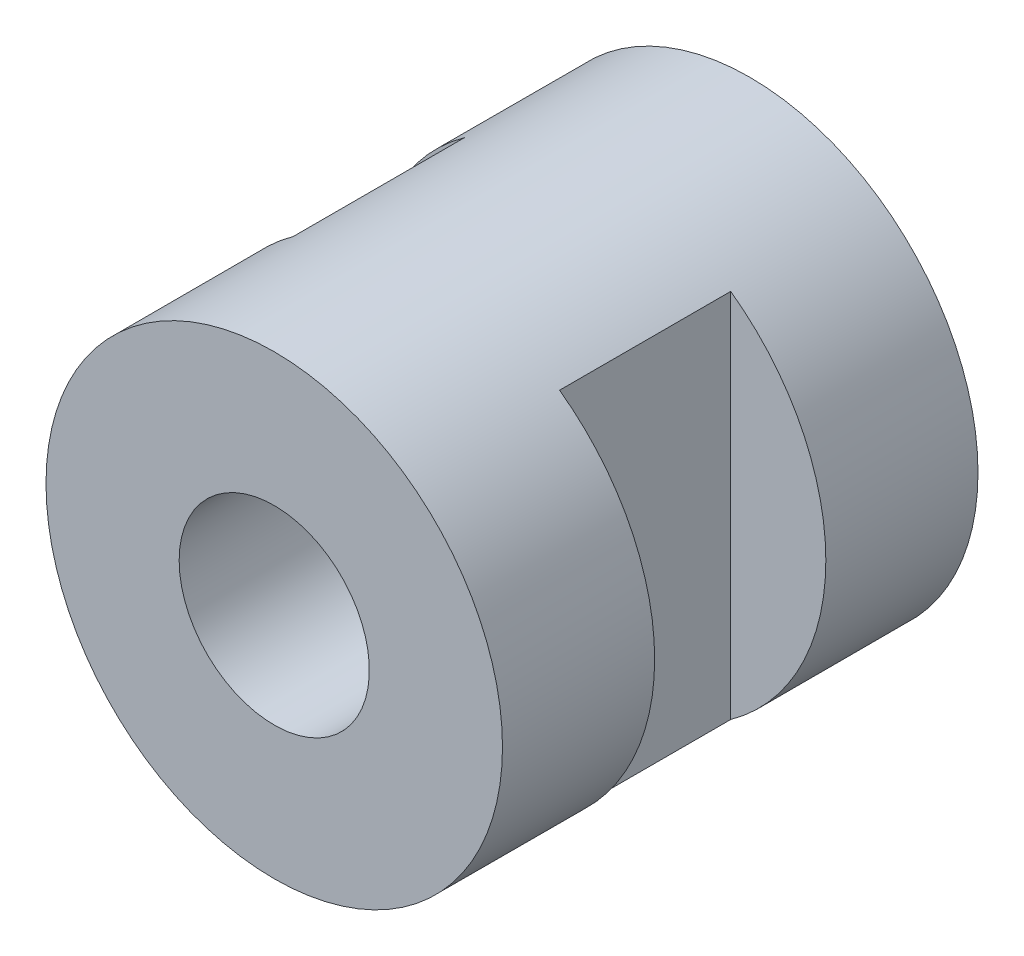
from build123d import *

# Parameters (mm, degrees)
SKETCH_1_R          = 6
EXTRUDE_1_DEPTH     = 12.5
SKETCH_2_W          = 3.194481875
SKETCH_2_H          = 4.5
CUT_EXTRUDE_1_DEPTH = 22.17191536
SKETCH_3_R          = 2.5
CUT_EXTRUDE_2_DEPTH = 12.5


with BuildPart() as part:
    # Sketch 1 → Extrude 1 (new body)
    with BuildSketch(Plane.XY):
        Circle(SKETCH_1_R)
    extrude(amount=EXTRUDE_1_DEPTH)

    # Sketch 2 → Cut-Extrude 1 (cut, through all)
    with BuildSketch(Plane(origin=(0, 10, 0), x_dir=(-1, 0, 0), z_dir=(0, 1, 0))):
        with Locations((-5.097240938, 6.25)):
            Rectangle(SKETCH_2_W, SKETCH_2_H)
        with Locations((5.097240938, 6.25)):
            Rectangle(SKETCH_2_W, SKETCH_2_H)
    extrude(amount=-CUT_EXTRUDE_1_DEPTH, mode=Mode.SUBTRACT)

    # Sketch 3 → Cut-Extrude 2 (cut)
    with BuildSketch(Plane(origin=(0, 0, 0), x_dir=(-1, 0, 0), z_dir=(0, 0, -1))):
        Circle(SKETCH_3_R)
    extrude(amount=-CUT_EXTRUDE_2_DEPTH, mode=Mode.SUBTRACT)


solid = part.part
